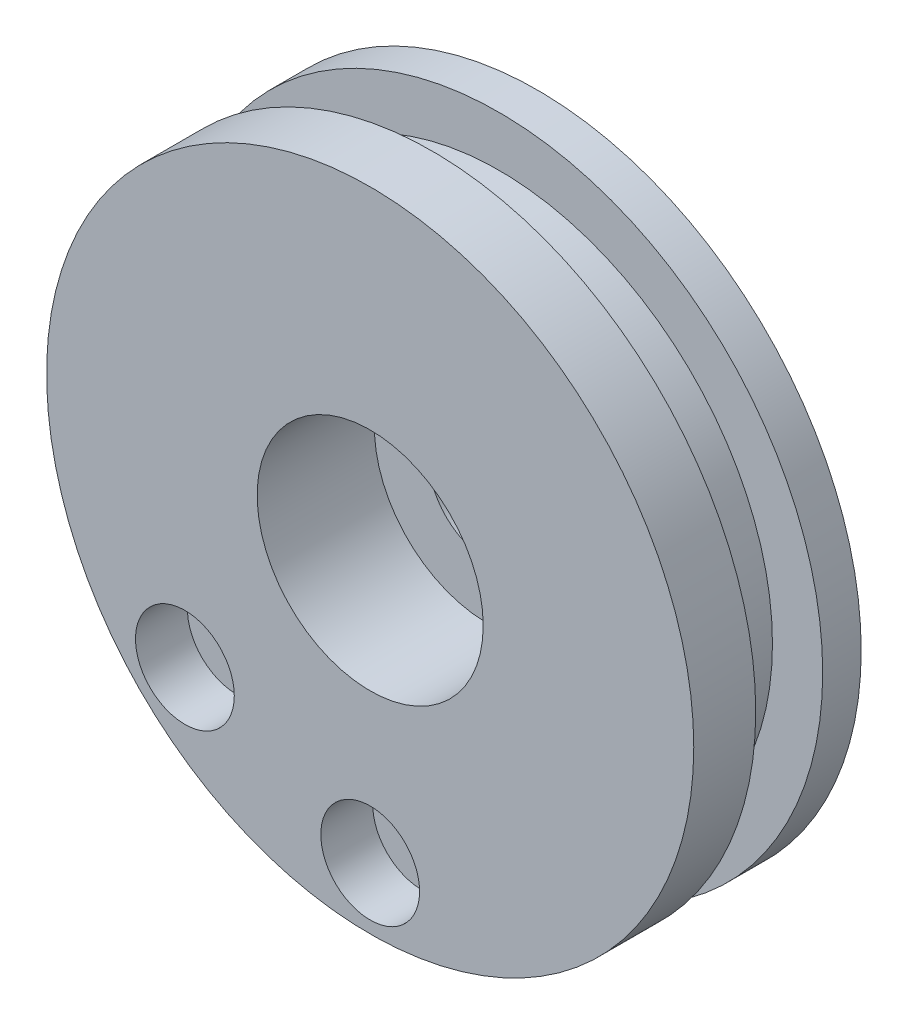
from build123d import *

# Parameters (mm, degrees)
SKETCH1_R          = 9.8171
EXTRUDE1_DEPTH     = 5.08
SKETCH2_R          = 1.778
CUT_EXTRUDE1_DEPTH = 15.783683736
SKETCH3_R          = 3.429
CUT_EXTRUDE2_DEPTH = 3.556
SKETCH4_R          = 1.4986
CUT_EXTRUDE3_DEPTH = 1.5748
SKETCH5_OUTSIDE_W  = 27.28
SKETCH5_OUTSIDE_H  = 27.28
SKETCH5_OUTSIDE_R  = 8.2931
CUT_EXTRUDE4_DEPTH = 2.032
SKETCH6_R          = 3.1877
CUT_EXTRUDE5_DEPTH = 0.635


with BuildPart() as part:
    # Sketch1 → Extrude1 (new body)
    with BuildSketch(Plane.XY):
        Circle(SKETCH1_R)
    extrude(amount=EXTRUDE1_DEPTH)

    # Sketch2 → Cut-Extrude1 (cut, through all)
    with BuildSketch(Plane.XY.offset(5.08)):
        Circle(SKETCH2_R)
    extrude(amount=-CUT_EXTRUDE1_DEPTH, mode=Mode.SUBTRACT)

    # Sketch3 → Cut-Extrude2 (cut)
    with BuildSketch(Plane.XY.offset(5.08)):
        Circle(SKETCH3_R)
    extrude(amount=-CUT_EXTRUDE2_DEPTH, mode=Mode.SUBTRACT)

    # Sketch4 → Cut-Extrude3 (cut)
    with BuildSketch(Plane.XY.offset(5.08)):
        with Locations((0, -7.9502)):
            Circle(SKETCH4_R)
        with Locations((-5.621640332, -5.621640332)):
            Circle(SKETCH4_R)
    extrude(amount=-CUT_EXTRUDE3_DEPTH, mode=Mode.SUBTRACT)

    # Sketch5 outside → Cut-Extrude4 (cut)
    with BuildSketch(Plane.XY.offset(3.2004)):
        Rectangle(SKETCH5_OUTSIDE_W, SKETCH5_OUTSIDE_H)
        Circle(SKETCH5_OUTSIDE_R, mode=Mode.SUBTRACT)
    extrude(amount=-CUT_EXTRUDE4_DEPTH, mode=Mode.SUBTRACT)

    # Sketch6 → Cut-Extrude5 (cut)
    with BuildSketch(Plane(origin=(0, 0, 0), x_dir=(-1, 0, 0), z_dir=(0, 0, -1))):
        Circle(SKETCH6_R)
    extrude(amount=-CUT_EXTRUDE5_DEPTH, mode=Mode.SUBTRACT)


solid = part.part
